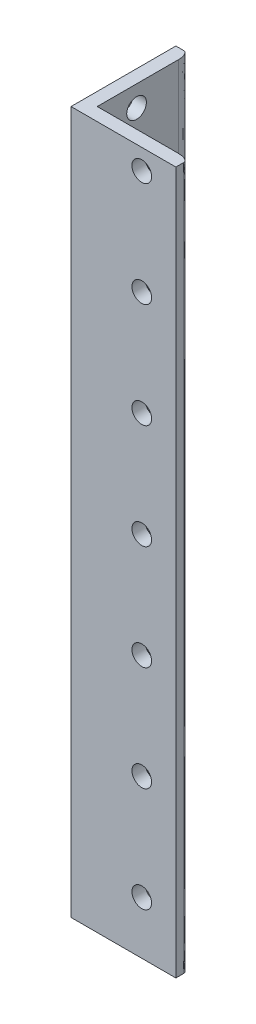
ISO-10303-21;
HEADER;
FILE_DESCRIPTION(('STEP AP214'),'2;1');
FILE_NAME('part.step','',(''),(''),'','','');
FILE_SCHEMA(('AUTOMOTIVE_DESIGN { 1 0 10303 214 1 1 1 1 }'));
ENDSEC;
DATA;
#1=APPLICATION_CONTEXT('core data for automotive mechanical design processes');
#2=APPLICATION_PROTOCOL_DEFINITION('international standard','automotive_design',2000,#1);
#3=PRODUCT_CONTEXT('',#1,'mechanical');
#4=PRODUCT('Part','Part','',(#3));
#5=PRODUCT_RELATED_PRODUCT_CATEGORY('part','',(#4));
#6=PRODUCT_DEFINITION_FORMATION('','',#4);
#7=PRODUCT_DEFINITION_CONTEXT('part definition',#1,'design');
#8=PRODUCT_DEFINITION('design','',#6,#7);
#9=PRODUCT_DEFINITION_SHAPE('','',#8);
#10=(LENGTH_UNIT() NAMED_UNIT(*) SI_UNIT(.MILLI.,.METRE.));
#11=(NAMED_UNIT(*) PLANE_ANGLE_UNIT() SI_UNIT($,.RADIAN.));
#12=(NAMED_UNIT(*) SI_UNIT($,.STERADIAN.) SOLID_ANGLE_UNIT());
#13=UNCERTAINTY_MEASURE_WITH_UNIT(LENGTH_MEASURE(1.E-05),#10,'distance_accuracy_value','');
#14=(GEOMETRIC_REPRESENTATION_CONTEXT(3) GLOBAL_UNCERTAINTY_ASSIGNED_CONTEXT((#13)) GLOBAL_UNIT_ASSIGNED_CONTEXT((#10,
#11,#12)) REPRESENTATION_CONTEXT('',''));
#15=CARTESIAN_POINT('',(0.,0.,0.));
#16=DIRECTION('',(0.,0.,1.));
#17=DIRECTION('',(1.,0.,0.));
#18=AXIS2_PLACEMENT_3D('',#15,#16,#17);
#19=CARTESIAN_POINT('',(0.,170.18,0.));
#20=DIRECTION('',(0.,0.,1.));
#21=DIRECTION('',(1.,0.,0.));
#22=AXIS2_PLACEMENT_3D('',#19,#20,#21);
#23=PLANE('',#22);
#24=DIRECTION('',(-1.,0.,0.));
#25=VECTOR('',#24,1.);
#26=CARTESIAN_POINT('',(0.,170.18,0.));
#27=LINE('',#26,#25);
#28=CARTESIAN_POINT('',(1.905,170.18,0.));
#29=VERTEX_POINT('',#28);
#30=CARTESIAN_POINT('',(0.,170.18,0.));
#31=VERTEX_POINT('',#30);
#32=EDGE_CURVE('E115',#29,#31,#27,.T.);
#33=ORIENTED_EDGE('',*,*,#32,.T.);
#34=DIRECTION('',(0.,1.,0.));
#35=VECTOR('',#34,1.);
#36=CARTESIAN_POINT('',(0.,170.18,0.));
#37=LINE('',#36,#35);
#38=CARTESIAN_POINT('',(0.,340.36,0.));
#39=VERTEX_POINT('',#38);
#40=EDGE_CURVE('E123',#31,#39,#37,.T.);
#41=ORIENTED_EDGE('',*,*,#40,.T.);
#42=DIRECTION('',(-1.,0.,0.));
#43=VECTOR('',#42,1.);
#44=CARTESIAN_POINT('',(0.,340.36,0.));
#45=LINE('',#44,#43);
#46=CARTESIAN_POINT('',(1.905,340.36,0.));
#47=VERTEX_POINT('',#46);
#48=EDGE_CURVE('E143',#47,#39,#45,.T.);
#49=ORIENTED_EDGE('',*,*,#48,.F.);
#50=CARTESIAN_POINT('',(1.905,161.671,0.));
#51=CARTESIAN_POINT('',(1.905,224.070333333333,0.));
#52=CARTESIAN_POINT('',(1.905,286.469666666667,0.));
#53=CARTESIAN_POINT('',(1.905,348.869,0.));
#54=(BOUNDED_CURVE() B_SPLINE_CURVE(3,(#50,#51,#52,#53),.UNSPECIFIED.,.F.,
.F.) B_SPLINE_CURVE_WITH_KNOTS((4,4),(-0.008509,0.178689),
.UNSPECIFIED.) CURVE() GEOMETRIC_REPRESENTATION_ITEM() RATIONAL_B_SPLINE_CURVE((1.,1.,1.,1.)) REPRESENTATION_ITEM(''));
#55=EDGE_CURVE('E130',#29,#47,#54,.T.);
#56=ORIENTED_EDGE('',*,*,#55,.F.);
#57=EDGE_LOOP('',(#33,#41,#49,#56));
#58=FACE_BOUND('',#57,.T.);
#59=ADVANCED_FACE('F42',(#58),#23,.F.);
#60=CARTESIAN_POINT('',(0.,170.18,0.));
#61=DIRECTION('',(1.,0.,0.));
#62=DIRECTION('',(0.,0.,-1.));
#63=AXIS2_PLACEMENT_3D('',#60,#61,#62);
#64=PLANE('',#63);
#65=CARTESIAN_POINT('',(0.,335.28,12.7));
#66=DIRECTION('',(-1.,0.,0.));
#67=DIRECTION('',(0.,0.,-1.));
#68=AXIS2_PLACEMENT_3D('',#65,#66,#67);
#69=CIRCLE('',#68,2.38125);
#70=CARTESIAN_POINT('',(0.,335.28,10.31875));
#71=VERTEX_POINT('',#70);
#72=EDGE_CURVE('E431',#71,#71,#69,.T.);
#73=ORIENTED_EDGE('',*,*,#72,.F.);
#74=EDGE_LOOP('',(#73));
#75=FACE_BOUND('',#74,.T.);
#76=CARTESIAN_POINT('',(0.,309.88,12.7));
#77=DIRECTION('',(-1.,0.,0.));
#78=DIRECTION('',(0.,0.,-1.));
#79=AXIS2_PLACEMENT_3D('',#76,#77,#78);
#80=CIRCLE('',#79,2.38125);
#81=CARTESIAN_POINT('',(0.,309.88,10.31875));
#82=VERTEX_POINT('',#81);
#83=EDGE_CURVE('E425',#82,#82,#80,.T.);
#84=ORIENTED_EDGE('',*,*,#83,.F.);
#85=EDGE_LOOP('',(#84));
#86=FACE_BOUND('',#85,.T.);
#87=CARTESIAN_POINT('',(0.,284.48,12.7));
#88=DIRECTION('',(-1.,0.,0.));
#89=DIRECTION('',(0.,0.,-1.));
#90=AXIS2_PLACEMENT_3D('',#87,#88,#89);
#91=CIRCLE('',#90,2.38125);
#92=CARTESIAN_POINT('',(0.,284.48,10.31875));
#93=VERTEX_POINT('',#92);
#94=EDGE_CURVE('E419',#93,#93,#91,.T.);
#95=ORIENTED_EDGE('',*,*,#94,.F.);
#96=EDGE_LOOP('',(#95));
#97=FACE_BOUND('',#96,.T.);
#98=CARTESIAN_POINT('',(0.,259.08,12.7));
#99=DIRECTION('',(-1.,0.,0.));
#100=DIRECTION('',(0.,0.,-1.));
#101=AXIS2_PLACEMENT_3D('',#98,#99,#100);
#102=CIRCLE('',#101,2.38125);
#103=CARTESIAN_POINT('',(0.,259.08,10.31875));
#104=VERTEX_POINT('',#103);
#105=EDGE_CURVE('E413',#104,#104,#102,.T.);
#106=ORIENTED_EDGE('',*,*,#105,.F.);
#107=EDGE_LOOP('',(#106));
#108=FACE_BOUND('',#107,.T.);
#109=CARTESIAN_POINT('',(0.,233.68,12.7));
#110=DIRECTION('',(-1.,0.,0.));
#111=DIRECTION('',(0.,0.,-1.));
#112=AXIS2_PLACEMENT_3D('',#109,#110,#111);
#113=CIRCLE('',#112,2.38125);
#114=CARTESIAN_POINT('',(0.,233.68,10.31875));
#115=VERTEX_POINT('',#114);
#116=EDGE_CURVE('E407',#115,#115,#113,.T.);
#117=ORIENTED_EDGE('',*,*,#116,.F.);
#118=EDGE_LOOP('',(#117));
#119=FACE_BOUND('',#118,.T.);
#120=CARTESIAN_POINT('',(0.,208.28,12.7));
#121=DIRECTION('',(-1.,0.,0.));
#122=DIRECTION('',(0.,0.,-1.));
#123=AXIS2_PLACEMENT_3D('',#120,#121,#122);
#124=CIRCLE('',#123,2.38125);
#125=CARTESIAN_POINT('',(0.,208.28,10.31875));
#126=VERTEX_POINT('',#125);
#127=EDGE_CURVE('E401',#126,#126,#124,.T.);
#128=ORIENTED_EDGE('',*,*,#127,.F.);
#129=EDGE_LOOP('',(#128));
#130=FACE_BOUND('',#129,.T.);
#131=CARTESIAN_POINT('',(0.,182.88,12.7));
#132=DIRECTION('',(-1.,0.,0.));
#133=DIRECTION('',(0.,0.,-1.));
#134=AXIS2_PLACEMENT_3D('',#131,#132,#133);
#135=CIRCLE('',#134,2.38125);
#136=CARTESIAN_POINT('',(0.,182.88,10.31875));
#137=VERTEX_POINT('',#136);
#138=EDGE_CURVE('E395',#137,#137,#135,.T.);
#139=ORIENTED_EDGE('',*,*,#138,.F.);
#140=EDGE_LOOP('',(#139));
#141=FACE_BOUND('',#140,.T.);
#142=DIRECTION('',(0.,0.,1.));
#143=VECTOR('',#142,1.);
#144=CARTESIAN_POINT('',(0.,340.36,0.));
#145=LINE('',#144,#143);
#146=CARTESIAN_POINT('',(0.,340.36,25.4));
#147=VERTEX_POINT('',#146);
#148=EDGE_CURVE('E126',#39,#147,#145,.T.);
#149=ORIENTED_EDGE('',*,*,#148,.F.);
#150=ORIENTED_EDGE('',*,*,#40,.F.);
#151=DIRECTION('',(0.,0.,1.));
#152=VECTOR('',#151,1.);
#153=CARTESIAN_POINT('',(0.,170.18,0.));
#154=LINE('',#153,#152);
#155=CARTESIAN_POINT('',(0.,170.18,25.4));
#156=VERTEX_POINT('',#155);
#157=EDGE_CURVE('E111',#31,#156,#154,.T.);
#158=ORIENTED_EDGE('',*,*,#157,.T.);
#159=DIRECTION('',(0.,1.,0.));
#160=VECTOR('',#159,1.);
#161=CARTESIAN_POINT('',(0.,170.18,25.4));
#162=LINE('',#161,#160);
#163=EDGE_CURVE('E131',#156,#147,#162,.T.);
#164=ORIENTED_EDGE('',*,*,#163,.T.);
#165=EDGE_LOOP('',(#149,#150,#158,#164));
#166=FACE_BOUND('',#165,.T.);
#167=ADVANCED_FACE('F124',(#75,#86,#97,#108,#119,#130,#141,#166),#64,.F.);
#168=CARTESIAN_POINT('',(0.,170.18,25.4));
#169=DIRECTION('',(0.,0.,-1.));
#170=DIRECTION('',(-1.,0.,0.));
#171=AXIS2_PLACEMENT_3D('',#168,#169,#170);
#172=PLANE('',#171);
#173=CARTESIAN_POINT('',(17.13738,335.38922,25.4));
#174=DIRECTION('',(0.,0.,1.));
#175=DIRECTION('',(-1.,0.,0.));
#176=AXIS2_PLACEMENT_3D('',#173,#174,#175);
#177=CIRCLE('',#176,2.38125);
#178=CARTESIAN_POINT('',(14.75613,335.38922,25.4));
#179=VERTEX_POINT('',#178);
#180=EDGE_CURVE('E389',#179,#179,#177,.T.);
#181=ORIENTED_EDGE('',*,*,#180,.F.);
#182=EDGE_LOOP('',(#181));
#183=FACE_BOUND('',#182,.T.);
#184=CARTESIAN_POINT('',(17.13738,309.98922,25.4));
#185=DIRECTION('',(0.,0.,1.));
#186=DIRECTION('',(-1.,0.,0.));
#187=AXIS2_PLACEMENT_3D('',#184,#185,#186);
#188=CIRCLE('',#187,2.38125);
#189=CARTESIAN_POINT('',(14.75613,309.98922,25.4));
#190=VERTEX_POINT('',#189);
#191=EDGE_CURVE('E383',#190,#190,#188,.T.);
#192=ORIENTED_EDGE('',*,*,#191,.F.);
#193=EDGE_LOOP('',(#192));
#194=FACE_BOUND('',#193,.T.);
#195=CARTESIAN_POINT('',(17.13738,284.58922,25.4));
#196=DIRECTION('',(0.,0.,1.));
#197=DIRECTION('',(-1.,0.,0.));
#198=AXIS2_PLACEMENT_3D('',#195,#196,#197);
#199=CIRCLE('',#198,2.38125);
#200=CARTESIAN_POINT('',(14.75613,284.58922,25.4));
#201=VERTEX_POINT('',#200);
#202=EDGE_CURVE('E377',#201,#201,#199,.T.);
#203=ORIENTED_EDGE('',*,*,#202,.F.);
#204=EDGE_LOOP('',(#203));
#205=FACE_BOUND('',#204,.T.);
#206=CARTESIAN_POINT('',(17.13738,259.18922,25.4));
#207=DIRECTION('',(0.,0.,1.));
#208=DIRECTION('',(-1.,0.,0.));
#209=AXIS2_PLACEMENT_3D('',#206,#207,#208);
#210=CIRCLE('',#209,2.38125);
#211=CARTESIAN_POINT('',(14.75613,259.18922,25.4));
#212=VERTEX_POINT('',#211);
#213=EDGE_CURVE('E371',#212,#212,#210,.T.);
#214=ORIENTED_EDGE('',*,*,#213,.F.);
#215=EDGE_LOOP('',(#214));
#216=FACE_BOUND('',#215,.T.);
#217=CARTESIAN_POINT('',(17.13738,233.78922,25.4));
#218=DIRECTION('',(0.,0.,1.));
#219=DIRECTION('',(-1.,0.,0.));
#220=AXIS2_PLACEMENT_3D('',#217,#218,#219);
#221=CIRCLE('',#220,2.38125);
#222=CARTESIAN_POINT('',(14.75613,233.78922,25.4));
#223=VERTEX_POINT('',#222);
#224=EDGE_CURVE('E365',#223,#223,#221,.T.);
#225=ORIENTED_EDGE('',*,*,#224,.F.);
#226=EDGE_LOOP('',(#225));
#227=FACE_BOUND('',#226,.T.);
#228=CARTESIAN_POINT('',(17.13738,208.38922,25.4));
#229=DIRECTION('',(0.,0.,1.));
#230=DIRECTION('',(-1.,0.,0.));
#231=AXIS2_PLACEMENT_3D('',#228,#229,#230);
#232=CIRCLE('',#231,2.38125);
#233=CARTESIAN_POINT('',(14.75613,208.38922,25.4));
#234=VERTEX_POINT('',#233);
#235=EDGE_CURVE('E359',#234,#234,#232,.T.);
#236=ORIENTED_EDGE('',*,*,#235,.F.);
#237=EDGE_LOOP('',(#236));
#238=FACE_BOUND('',#237,.T.);
#239=CARTESIAN_POINT('',(17.13738,182.98922,25.4));
#240=DIRECTION('',(0.,0.,1.));
#241=DIRECTION('',(-1.,0.,0.));
#242=AXIS2_PLACEMENT_3D('',#239,#240,#241);
#243=CIRCLE('',#242,2.38125);
#244=CARTESIAN_POINT('',(14.75613,182.98922,25.4));
#245=VERTEX_POINT('',#244);
#246=EDGE_CURVE('E230',#245,#245,#243,.T.);
#247=ORIENTED_EDGE('',*,*,#246,.F.);
#248=EDGE_LOOP('',(#247));
#249=FACE_BOUND('',#248,.T.);
#250=DIRECTION('',(1.,0.,0.));
#251=VECTOR('',#250,1.);
#252=CARTESIAN_POINT('',(0.,340.36,25.4));
#253=LINE('',#252,#251);
#254=CARTESIAN_POINT('',(25.4,340.36,25.4));
#255=VERTEX_POINT('',#254);
#256=EDGE_CURVE('E226',#147,#255,#253,.T.);
#257=ORIENTED_EDGE('',*,*,#256,.F.);
#258=ORIENTED_EDGE('',*,*,#163,.F.);
#259=DIRECTION('',(1.,0.,0.));
#260=VECTOR('',#259,1.);
#261=CARTESIAN_POINT('',(0.,170.18,25.4));
#262=LINE('',#261,#260);
#263=CARTESIAN_POINT('',(25.4,170.18,25.4));
#264=VERTEX_POINT('',#263);
#265=EDGE_CURVE('E117',#156,#264,#262,.T.);
#266=ORIENTED_EDGE('',*,*,#265,.T.);
#267=DIRECTION('',(0.,1.,0.));
#268=VECTOR('',#267,1.);
#269=CARTESIAN_POINT('',(25.4,170.18,25.4));
#270=LINE('',#269,#268);
#271=EDGE_CURVE('E217',#264,#255,#270,.T.);
#272=ORIENTED_EDGE('',*,*,#271,.T.);
#273=EDGE_LOOP('',(#257,#258,#266,#272));
#274=FACE_BOUND('',#273,.T.);
#275=ADVANCED_FACE('F184',(#183,#194,#205,#216,#227,#238,#249,#274),#172,.F.);
#276=CARTESIAN_POINT('',(25.4,170.18,22.225));
#277=DIRECTION('',(-1.,0.,0.));
#278=DIRECTION('',(0.,0.,1.));
#279=AXIS2_PLACEMENT_3D('',#276,#277,#278);
#280=PLANE('',#279);
#281=DIRECTION('',(0.,0.,-1.));
#282=VECTOR('',#281,1.);
#283=CARTESIAN_POINT('',(25.4,340.36,22.225));
#284=LINE('',#283,#282);
#285=CARTESIAN_POINT('',(25.4,340.36,23.495));
#286=VERTEX_POINT('',#285);
#287=EDGE_CURVE('E228',#255,#286,#284,.T.);
#288=ORIENTED_EDGE('',*,*,#287,.F.);
#289=ORIENTED_EDGE('',*,*,#271,.F.);
#290=DIRECTION('',(0.,0.,-1.));
#291=VECTOR('',#290,1.);
#292=CARTESIAN_POINT('',(25.4,170.18,22.225));
#293=LINE('',#292,#291);
#294=CARTESIAN_POINT('',(25.4,170.18,23.495));
#295=VERTEX_POINT('',#294);
#296=EDGE_CURVE('E152',#264,#295,#293,.T.);
#297=ORIENTED_EDGE('',*,*,#296,.T.);
#298=CARTESIAN_POINT('',(25.4,348.869,23.495));
#299=CARTESIAN_POINT('',(25.4,286.469666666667,23.495));
#300=CARTESIAN_POINT('',(25.4,224.070333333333,23.495));
#301=CARTESIAN_POINT('',(25.4,161.671,23.495));
#302=(BOUNDED_CURVE() B_SPLINE_CURVE(3,(#298,#299,#300,#301),.UNSPECIFIED.,.F.,
.F.) B_SPLINE_CURVE_WITH_KNOTS((4,4),(-0.00850899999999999,0.178689),
.UNSPECIFIED.) CURVE() GEOMETRIC_REPRESENTATION_ITEM() RATIONAL_B_SPLINE_CURVE((1.,1.,1.,1.)) REPRESENTATION_ITEM(''));
#303=EDGE_CURVE('E55',#286,#295,#302,.T.);
#304=ORIENTED_EDGE('',*,*,#303,.F.);
#305=EDGE_LOOP('',(#288,#289,#297,#304));
#306=FACE_BOUND('',#305,.T.);
#307=ADVANCED_FACE('F173',(#306),#280,.F.);
#308=CARTESIAN_POINT('',(3.175,170.18,22.225));
#309=DIRECTION('',(0.,0.,1.));
#310=DIRECTION('',(1.,0.,0.));
#311=AXIS2_PLACEMENT_3D('',#308,#309,#310);
#312=PLANE('',#311);
#313=CARTESIAN_POINT('',(17.13738,335.38922,22.225));
#314=DIRECTION('',(0.,0.,1.));
#315=DIRECTION('',(-1.,0.,0.));
#316=AXIS2_PLACEMENT_3D('',#313,#314,#315);
#317=CIRCLE('',#316,2.38125);
#318=CARTESIAN_POINT('',(14.75613,335.38922,22.225));
#319=VERTEX_POINT('',#318);
#320=EDGE_CURVE('E392',#319,#319,#317,.T.);
#321=ORIENTED_EDGE('',*,*,#320,.T.);
#322=EDGE_LOOP('',(#321));
#323=FACE_BOUND('',#322,.T.);
#324=CARTESIAN_POINT('',(17.13738,309.98922,22.225));
#325=DIRECTION('',(0.,0.,1.));
#326=DIRECTION('',(-1.,0.,0.));
#327=AXIS2_PLACEMENT_3D('',#324,#325,#326);
#328=CIRCLE('',#327,2.38125);
#329=CARTESIAN_POINT('',(14.75613,309.98922,22.225));
#330=VERTEX_POINT('',#329);
#331=EDGE_CURVE('E386',#330,#330,#328,.T.);
#332=ORIENTED_EDGE('',*,*,#331,.T.);
#333=EDGE_LOOP('',(#332));
#334=FACE_BOUND('',#333,.T.);
#335=CARTESIAN_POINT('',(17.13738,284.58922,22.225));
#336=DIRECTION('',(0.,0.,1.));
#337=DIRECTION('',(-1.,0.,0.));
#338=AXIS2_PLACEMENT_3D('',#335,#336,#337);
#339=CIRCLE('',#338,2.38125);
#340=CARTESIAN_POINT('',(14.75613,284.58922,22.225));
#341=VERTEX_POINT('',#340);
#342=EDGE_CURVE('E380',#341,#341,#339,.T.);
#343=ORIENTED_EDGE('',*,*,#342,.T.);
#344=EDGE_LOOP('',(#343));
#345=FACE_BOUND('',#344,.T.);
#346=CARTESIAN_POINT('',(17.13738,259.18922,22.225));
#347=DIRECTION('',(0.,0.,1.));
#348=DIRECTION('',(-1.,0.,0.));
#349=AXIS2_PLACEMENT_3D('',#346,#347,#348);
#350=CIRCLE('',#349,2.38125);
#351=CARTESIAN_POINT('',(14.75613,259.18922,22.225));
#352=VERTEX_POINT('',#351);
#353=EDGE_CURVE('E374',#352,#352,#350,.T.);
#354=ORIENTED_EDGE('',*,*,#353,.T.);
#355=EDGE_LOOP('',(#354));
#356=FACE_BOUND('',#355,.T.);
#357=CARTESIAN_POINT('',(17.13738,233.78922,22.225));
#358=DIRECTION('',(0.,0.,1.));
#359=DIRECTION('',(-1.,0.,0.));
#360=AXIS2_PLACEMENT_3D('',#357,#358,#359);
#361=CIRCLE('',#360,2.38125);
#362=CARTESIAN_POINT('',(14.75613,233.78922,22.225));
#363=VERTEX_POINT('',#362);
#364=EDGE_CURVE('E368',#363,#363,#361,.T.);
#365=ORIENTED_EDGE('',*,*,#364,.T.);
#366=EDGE_LOOP('',(#365));
#367=FACE_BOUND('',#366,.T.);
#368=CARTESIAN_POINT('',(17.13738,208.38922,22.225));
#369=DIRECTION('',(0.,0.,1.));
#370=DIRECTION('',(-1.,0.,0.));
#371=AXIS2_PLACEMENT_3D('',#368,#369,#370);
#372=CIRCLE('',#371,2.38125);
#373=CARTESIAN_POINT('',(14.75613,208.38922,22.225));
#374=VERTEX_POINT('',#373);
#375=EDGE_CURVE('E361',#374,#374,#372,.T.);
#376=ORIENTED_EDGE('',*,*,#375,.T.);
#377=EDGE_LOOP('',(#376));
#378=FACE_BOUND('',#377,.T.);
#379=CARTESIAN_POINT('',(17.13738,182.98922,22.225));
#380=DIRECTION('',(0.,0.,1.));
#381=DIRECTION('',(-1.,0.,0.));
#382=AXIS2_PLACEMENT_3D('',#379,#380,#381);
#383=CIRCLE('',#382,2.38125);
#384=CARTESIAN_POINT('',(14.75613,182.98922,22.225));
#385=VERTEX_POINT('',#384);
#386=EDGE_CURVE('E148',#385,#385,#383,.T.);
#387=ORIENTED_EDGE('',*,*,#386,.T.);
#388=EDGE_LOOP('',(#387));
#389=FACE_BOUND('',#388,.T.);
#390=DIRECTION('',(-1.,0.,0.));
#391=VECTOR('',#390,1.);
#392=CARTESIAN_POINT('',(3.175,170.18,22.225));
#393=LINE('',#392,#391);
#394=CARTESIAN_POINT('',(22.86,170.18,22.225));
#395=VERTEX_POINT('',#394);
#396=CARTESIAN_POINT('',(3.175,170.18,22.225));
#397=VERTEX_POINT('',#396);
#398=EDGE_CURVE('E161',#395,#397,#393,.T.);
#399=ORIENTED_EDGE('',*,*,#398,.T.);
#400=DIRECTION('',(0.,1.,0.));
#401=VECTOR('',#400,1.);
#402=CARTESIAN_POINT('',(3.175,170.18,22.225));
#403=LINE('',#402,#401);
#404=CARTESIAN_POINT('',(3.175,340.36,22.225));
#405=VERTEX_POINT('',#404);
#406=EDGE_CURVE('E214',#397,#405,#403,.T.);
#407=ORIENTED_EDGE('',*,*,#406,.T.);
#408=DIRECTION('',(-1.,0.,0.));
#409=VECTOR('',#408,1.);
#410=CARTESIAN_POINT('',(3.175,340.36,22.225));
#411=LINE('',#410,#409);
#412=CARTESIAN_POINT('',(22.86,340.36,22.225));
#413=VERTEX_POINT('',#412);
#414=EDGE_CURVE('E139',#413,#405,#411,.T.);
#415=ORIENTED_EDGE('',*,*,#414,.F.);
#416=CARTESIAN_POINT('',(22.86,161.671,22.225));
#417=CARTESIAN_POINT('',(22.86,224.070333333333,22.225));
#418=CARTESIAN_POINT('',(22.86,286.469666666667,22.225));
#419=CARTESIAN_POINT('',(22.86,348.869,22.225));
#420=(BOUNDED_CURVE() B_SPLINE_CURVE(3,(#416,#417,#418,#419),.UNSPECIFIED.,.F.,
.F.) B_SPLINE_CURVE_WITH_KNOTS((4,4),(-0.008509,0.178689),
.UNSPECIFIED.) CURVE() GEOMETRIC_REPRESENTATION_ITEM() RATIONAL_B_SPLINE_CURVE((1.,1.,1.,1.)) REPRESENTATION_ITEM(''));
#421=EDGE_CURVE('E239',#395,#413,#420,.T.);
#422=ORIENTED_EDGE('',*,*,#421,.F.);
#423=EDGE_LOOP('',(#399,#407,#415,#422));
#424=FACE_BOUND('',#423,.T.);
#425=ADVANCED_FACE('F183',(#323,#334,#345,#356,#367,#378,#389,#424),#312,.F.);
#426=CARTESIAN_POINT('',(3.175,170.18,0.));
#427=DIRECTION('',(-1.,0.,0.));
#428=DIRECTION('',(0.,0.,1.));
#429=AXIS2_PLACEMENT_3D('',#426,#427,#428);
#430=PLANE('',#429);
#431=CARTESIAN_POINT('',(3.175,335.28,12.7));
#432=DIRECTION('',(-1.,0.,0.));
#433=DIRECTION('',(0.,0.,-1.));
#434=AXIS2_PLACEMENT_3D('',#431,#432,#433);
#435=CIRCLE('',#434,2.38125);
#436=CARTESIAN_POINT('',(3.175,335.28,10.31875));
#437=VERTEX_POINT('',#436);
#438=EDGE_CURVE('E434',#437,#437,#435,.T.);
#439=ORIENTED_EDGE('',*,*,#438,.T.);
#440=EDGE_LOOP('',(#439));
#441=FACE_BOUND('',#440,.T.);
#442=CARTESIAN_POINT('',(3.175,309.88,12.7));
#443=DIRECTION('',(-1.,0.,0.));
#444=DIRECTION('',(0.,0.,-1.));
#445=AXIS2_PLACEMENT_3D('',#442,#443,#444);
#446=CIRCLE('',#445,2.38125);
#447=CARTESIAN_POINT('',(3.175,309.88,10.31875));
#448=VERTEX_POINT('',#447);
#449=EDGE_CURVE('E428',#448,#448,#446,.T.);
#450=ORIENTED_EDGE('',*,*,#449,.T.);
#451=EDGE_LOOP('',(#450));
#452=FACE_BOUND('',#451,.T.);
#453=CARTESIAN_POINT('',(3.175,284.48,12.7));
#454=DIRECTION('',(-1.,0.,0.));
#455=DIRECTION('',(0.,0.,-1.));
#456=AXIS2_PLACEMENT_3D('',#453,#454,#455);
#457=CIRCLE('',#456,2.38125);
#458=CARTESIAN_POINT('',(3.175,284.48,10.31875));
#459=VERTEX_POINT('',#458);
#460=EDGE_CURVE('E422',#459,#459,#457,.T.);
#461=ORIENTED_EDGE('',*,*,#460,.T.);
#462=EDGE_LOOP('',(#461));
#463=FACE_BOUND('',#462,.T.);
#464=CARTESIAN_POINT('',(3.175,259.08,12.7));
#465=DIRECTION('',(-1.,0.,0.));
#466=DIRECTION('',(0.,0.,-1.));
#467=AXIS2_PLACEMENT_3D('',#464,#465,#466);
#468=CIRCLE('',#467,2.38125);
#469=CARTESIAN_POINT('',(3.175,259.08,10.31875));
#470=VERTEX_POINT('',#469);
#471=EDGE_CURVE('E416',#470,#470,#468,.T.);
#472=ORIENTED_EDGE('',*,*,#471,.T.);
#473=EDGE_LOOP('',(#472));
#474=FACE_BOUND('',#473,.T.);
#475=CARTESIAN_POINT('',(3.175,233.68,12.7));
#476=DIRECTION('',(-1.,0.,0.));
#477=DIRECTION('',(0.,0.,-1.));
#478=AXIS2_PLACEMENT_3D('',#475,#476,#477);
#479=CIRCLE('',#478,2.38125);
#480=CARTESIAN_POINT('',(3.175,233.68,10.31875));
#481=VERTEX_POINT('',#480);
#482=EDGE_CURVE('E410',#481,#481,#479,.T.);
#483=ORIENTED_EDGE('',*,*,#482,.T.);
#484=EDGE_LOOP('',(#483));
#485=FACE_BOUND('',#484,.T.);
#486=CARTESIAN_POINT('',(3.175,208.28,12.7));
#487=DIRECTION('',(-1.,0.,0.));
#488=DIRECTION('',(0.,0.,-1.));
#489=AXIS2_PLACEMENT_3D('',#486,#487,#488);
#490=CIRCLE('',#489,2.38125);
#491=CARTESIAN_POINT('',(3.175,208.28,10.31875));
#492=VERTEX_POINT('',#491);
#493=EDGE_CURVE('E404',#492,#492,#490,.T.);
#494=ORIENTED_EDGE('',*,*,#493,.T.);
#495=EDGE_LOOP('',(#494));
#496=FACE_BOUND('',#495,.T.);
#497=CARTESIAN_POINT('',(3.175,182.88,12.7));
#498=DIRECTION('',(-1.,0.,0.));
#499=DIRECTION('',(0.,0.,-1.));
#500=AXIS2_PLACEMENT_3D('',#497,#498,#499);
#501=CIRCLE('',#500,2.38125);
#502=CARTESIAN_POINT('',(3.175,182.88,10.31875));
#503=VERTEX_POINT('',#502);
#504=EDGE_CURVE('E398',#503,#503,#501,.T.);
#505=ORIENTED_EDGE('',*,*,#504,.T.);
#506=EDGE_LOOP('',(#505));
#507=FACE_BOUND('',#506,.T.);
#508=DIRECTION('',(0.,0.,-1.));
#509=VECTOR('',#508,1.);
#510=CARTESIAN_POINT('',(3.175,340.36,0.));
#511=LINE('',#510,#509);
#512=CARTESIAN_POINT('',(3.175,340.36,2.54));
#513=VERTEX_POINT('',#512);
#514=EDGE_CURVE('E136',#405,#513,#511,.T.);
#515=ORIENTED_EDGE('',*,*,#514,.F.);
#516=ORIENTED_EDGE('',*,*,#406,.F.);
#517=DIRECTION('',(0.,0.,-1.));
#518=VECTOR('',#517,1.);
#519=CARTESIAN_POINT('',(3.175,170.18,0.));
#520=LINE('',#519,#518);
#521=CARTESIAN_POINT('',(3.175,170.18,2.54));
#522=VERTEX_POINT('',#521);
#523=EDGE_CURVE('E218',#397,#522,#520,.T.);
#524=ORIENTED_EDGE('',*,*,#523,.T.);
#525=CARTESIAN_POINT('',(3.175,348.869,2.54));
#526=CARTESIAN_POINT('',(3.175,286.469666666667,2.54));
#527=CARTESIAN_POINT('',(3.175,224.070333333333,2.54));
#528=CARTESIAN_POINT('',(3.175,161.671,2.54));
#529=(BOUNDED_CURVE() B_SPLINE_CURVE(3,(#525,#526,#527,#528),.UNSPECIFIED.,.F.,
.F.) B_SPLINE_CURVE_WITH_KNOTS((4,4),(-0.00850899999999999,0.178689),
.UNSPECIFIED.) CURVE() GEOMETRIC_REPRESENTATION_ITEM() RATIONAL_B_SPLINE_CURVE((1.,1.,1.,1.)) REPRESENTATION_ITEM(''));
#530=EDGE_CURVE('E265',#513,#522,#529,.T.);
#531=ORIENTED_EDGE('',*,*,#530,.F.);
#532=EDGE_LOOP('',(#515,#516,#524,#531));
#533=FACE_BOUND('',#532,.T.);
#534=ADVANCED_FACE('F270',(#441,#452,#463,#474,#485,#496,#507,#533),#430,.F.);
#535=CARTESIAN_POINT('',(0.,170.18,0.));
#536=DIRECTION('',(0.,1.,0.));
#537=DIRECTION('',(0.,0.,-1.));
#538=AXIS2_PLACEMENT_3D('',#535,#536,#537);
#539=PLANE('',#538);
#540=ORIENTED_EDGE('',*,*,#296,.F.);
#541=ORIENTED_EDGE('',*,*,#265,.F.);
#542=ORIENTED_EDGE('',*,*,#157,.F.);
#543=ORIENTED_EDGE('',*,*,#32,.F.);
#544=CARTESIAN_POINT('',(3.175,170.18,2.54));
#545=CARTESIAN_POINT('',(3.175,170.18,0.));
#546=CARTESIAN_POINT('',(1.905,170.18,0.));
#547=(BOUNDED_CURVE() B_SPLINE_CURVE(2,(#544,#545,#546),.UNSPECIFIED.,.F.,
.F.) B_SPLINE_CURVE_WITH_KNOTS((3,3),(0.,1.),
.UNSPECIFIED.) CURVE() GEOMETRIC_REPRESENTATION_ITEM() RATIONAL_B_SPLINE_CURVE((1.,
0.707106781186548,1.)) REPRESENTATION_ITEM(''));
#548=EDGE_CURVE('E245',#522,#29,#547,.T.);
#549=ORIENTED_EDGE('',*,*,#548,.F.);
#550=ORIENTED_EDGE('',*,*,#523,.F.);
#551=ORIENTED_EDGE('',*,*,#398,.F.);
#552=CARTESIAN_POINT('',(25.4,170.18,23.495));
#553=CARTESIAN_POINT('',(25.4,170.18,22.225));
#554=CARTESIAN_POINT('',(22.86,170.18,22.225));
#555=(BOUNDED_CURVE() B_SPLINE_CURVE(2,(#552,#553,#554),.UNSPECIFIED.,.F.,
.F.) B_SPLINE_CURVE_WITH_KNOTS((3,3),(0.,1.),
.UNSPECIFIED.) CURVE() GEOMETRIC_REPRESENTATION_ITEM() RATIONAL_B_SPLINE_CURVE((1.,
0.707106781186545,1.)) REPRESENTATION_ITEM(''));
#556=EDGE_CURVE('E12',#295,#395,#555,.T.);
#557=ORIENTED_EDGE('',*,*,#556,.F.);
#558=EDGE_LOOP('',(#540,#541,#542,#543,#549,#550,#551,#557));
#559=FACE_BOUND('',#558,.T.);
#560=ADVANCED_FACE('F113',(#559),#539,.F.);
#561=CARTESIAN_POINT('',(0.,340.36,0.));
#562=DIRECTION('',(0.,1.,0.));
#563=DIRECTION('',(0.,0.,-1.));
#564=AXIS2_PLACEMENT_3D('',#561,#562,#563);
#565=PLANE('',#564);
#566=ORIENTED_EDGE('',*,*,#414,.T.);
#567=ORIENTED_EDGE('',*,*,#514,.T.);
#568=CARTESIAN_POINT('',(1.905,340.36,0.));
#569=CARTESIAN_POINT('',(3.175,340.36,0.));
#570=CARTESIAN_POINT('',(3.175,340.36,2.54));
#571=(BOUNDED_CURVE() B_SPLINE_CURVE(2,(#568,#569,#570),.UNSPECIFIED.,.F.,
.F.) B_SPLINE_CURVE_WITH_KNOTS((3,3),(0.,1.),
.UNSPECIFIED.) CURVE() GEOMETRIC_REPRESENTATION_ITEM() RATIONAL_B_SPLINE_CURVE((1.,
0.707106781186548,1.)) REPRESENTATION_ITEM(''));
#572=EDGE_CURVE('E313',#47,#513,#571,.T.);
#573=ORIENTED_EDGE('',*,*,#572,.F.);
#574=ORIENTED_EDGE('',*,*,#48,.T.);
#575=ORIENTED_EDGE('',*,*,#148,.T.);
#576=ORIENTED_EDGE('',*,*,#256,.T.);
#577=ORIENTED_EDGE('',*,*,#287,.T.);
#578=CARTESIAN_POINT('',(22.86,340.36,22.225));
#579=CARTESIAN_POINT('',(25.4,340.36,22.225));
#580=CARTESIAN_POINT('',(25.4,340.36,23.495));
#581=(BOUNDED_CURVE() B_SPLINE_CURVE(2,(#578,#579,#580),.UNSPECIFIED.,.F.,
.F.) B_SPLINE_CURVE_WITH_KNOTS((3,3),(0.,1.),
.UNSPECIFIED.) CURVE() GEOMETRIC_REPRESENTATION_ITEM() RATIONAL_B_SPLINE_CURVE((1.,
0.707106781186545,1.)) REPRESENTATION_ITEM(''));
#582=EDGE_CURVE('E68',#413,#286,#581,.T.);
#583=ORIENTED_EDGE('',*,*,#582,.F.);
#584=EDGE_LOOP('',(#566,#567,#573,#574,#575,#576,#577,#583));
#585=FACE_BOUND('',#584,.T.);
#586=ADVANCED_FACE('F225',(#585),#565,.T.);
#587=CARTESIAN_POINT('',(1.905,161.671,0.));
#588=CARTESIAN_POINT('',(1.905,224.070333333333,0.));
#589=CARTESIAN_POINT('',(1.905,286.469666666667,0.));
#590=CARTESIAN_POINT('',(1.905,348.869,0.));
#591=CARTESIAN_POINT('',(3.175,161.671,0.));
#592=CARTESIAN_POINT('',(3.175,224.070333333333,0.));
#593=CARTESIAN_POINT('',(3.175,286.469666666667,0.));
#594=CARTESIAN_POINT('',(3.175,348.869,0.));
#595=CARTESIAN_POINT('',(3.175,161.671,2.54));
#596=CARTESIAN_POINT('',(3.175,224.070333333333,2.54));
#597=CARTESIAN_POINT('',(3.175,286.469666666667,2.54));
#598=CARTESIAN_POINT('',(3.175,348.869,2.54));
#599=(BOUNDED_SURFACE() B_SPLINE_SURFACE(2,3,((#587,#588,#589,#590),(#591,#592,#593,#594),(#595,
#596,#597,#598)),.UNSPECIFIED.,.F.,.F.,.F.) B_SPLINE_SURFACE_WITH_KNOTS((3,3),(4,4),(0.,1.),
(-0.008509,0.178689),
.UNSPECIFIED.) GEOMETRIC_REPRESENTATION_ITEM() RATIONAL_B_SPLINE_SURFACE(((1.,1.,1.,1.),
(0.707106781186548,0.707106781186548,0.707106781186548,0.707106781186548),(1.,1.,1.,1.))) REPRESENTATION_ITEM('') SURFACE());
#600=ORIENTED_EDGE('',*,*,#548,.T.);
#601=ORIENTED_EDGE('',*,*,#55,.T.);
#602=ORIENTED_EDGE('',*,*,#572,.T.);
#603=ORIENTED_EDGE('',*,*,#530,.T.);
#604=EDGE_LOOP('',(#600,#601,#602,#603));
#605=FACE_BOUND('',#604,.T.);
#606=ADVANCED_FACE('F195',(#605),#599,.F.);
#607=CARTESIAN_POINT('',(22.86,161.671,22.225));
#608=CARTESIAN_POINT('',(22.86,224.070333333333,22.225));
#609=CARTESIAN_POINT('',(22.86,286.469666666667,22.225));
#610=CARTESIAN_POINT('',(22.86,348.869,22.225));
#611=CARTESIAN_POINT('',(25.4,161.671,22.225));
#612=CARTESIAN_POINT('',(25.4,224.070333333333,22.225));
#613=CARTESIAN_POINT('',(25.4,286.469666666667,22.225));
#614=CARTESIAN_POINT('',(25.4,348.869,22.225));
#615=CARTESIAN_POINT('',(25.4,161.671,23.495));
#616=CARTESIAN_POINT('',(25.4,224.070333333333,23.495));
#617=CARTESIAN_POINT('',(25.4,286.469666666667,23.495));
#618=CARTESIAN_POINT('',(25.4,348.869,23.495));
#619=(BOUNDED_SURFACE() B_SPLINE_SURFACE(2,3,((#607,#608,#609,#610),(#611,#612,#613,#614),(#615,
#616,#617,#618)),.UNSPECIFIED.,.F.,.F.,.F.) B_SPLINE_SURFACE_WITH_KNOTS((3,3),(4,4),(0.,1.),
(-0.008509,0.178689),
.UNSPECIFIED.) GEOMETRIC_REPRESENTATION_ITEM() RATIONAL_B_SPLINE_SURFACE(((1.,1.,1.,1.),
(0.707106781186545,0.707106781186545,0.707106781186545,0.707106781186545),(1.,1.,1.,1.))) REPRESENTATION_ITEM('') SURFACE());
#620=ORIENTED_EDGE('',*,*,#556,.T.);
#621=ORIENTED_EDGE('',*,*,#421,.T.);
#622=ORIENTED_EDGE('',*,*,#582,.T.);
#623=ORIENTED_EDGE('',*,*,#303,.T.);
#624=EDGE_LOOP('',(#620,#621,#622,#623));
#625=FACE_BOUND('',#624,.T.);
#626=ADVANCED_FACE('F44',(#625),#619,.F.);
#627=CARTESIAN_POINT('',(17.13738,182.98922,25.4));
#628=DIRECTION('',(0.,0.,-1.));
#629=DIRECTION('',(-1.,0.,0.));
#630=AXIS2_PLACEMENT_3D('',#627,#628,#629);
#631=CYLINDRICAL_SURFACE('',#630,2.38125);
#632=ORIENTED_EDGE('',*,*,#246,.T.);
#633=EDGE_LOOP('',(#632));
#634=FACE_BOUND('',#633,.T.);
#635=ORIENTED_EDGE('',*,*,#386,.F.);
#636=EDGE_LOOP('',(#635));
#637=FACE_BOUND('',#636,.T.);
#638=ADVANCED_FACE('F286',(#634,#637),#631,.F.);
#639=CARTESIAN_POINT('',(17.13738,208.38922,25.4));
#640=DIRECTION('',(0.,0.,-1.));
#641=DIRECTION('',(-1.,0.,0.));
#642=AXIS2_PLACEMENT_3D('',#639,#640,#641);
#643=CYLINDRICAL_SURFACE('',#642,2.38125);
#644=ORIENTED_EDGE('',*,*,#235,.T.);
#645=EDGE_LOOP('',(#644));
#646=FACE_BOUND('',#645,.T.);
#647=ORIENTED_EDGE('',*,*,#375,.F.);
#648=EDGE_LOOP('',(#647));
#649=FACE_BOUND('',#648,.T.);
#650=ADVANCED_FACE('F346',(#646,#649),#643,.F.);
#651=CARTESIAN_POINT('',(17.13738,233.78922,25.4));
#652=DIRECTION('',(0.,0.,-1.));
#653=DIRECTION('',(-1.,0.,0.));
#654=AXIS2_PLACEMENT_3D('',#651,#652,#653);
#655=CYLINDRICAL_SURFACE('',#654,2.38125);
#656=ORIENTED_EDGE('',*,*,#224,.T.);
#657=EDGE_LOOP('',(#656));
#658=FACE_BOUND('',#657,.T.);
#659=ORIENTED_EDGE('',*,*,#364,.F.);
#660=EDGE_LOOP('',(#659));
#661=FACE_BOUND('',#660,.T.);
#662=ADVANCED_FACE('F351',(#658,#661),#655,.F.);
#663=CARTESIAN_POINT('',(17.13738,259.18922,25.4));
#664=DIRECTION('',(0.,0.,-1.));
#665=DIRECTION('',(-1.,0.,0.));
#666=AXIS2_PLACEMENT_3D('',#663,#664,#665);
#667=CYLINDRICAL_SURFACE('',#666,2.38125);
#668=ORIENTED_EDGE('',*,*,#213,.T.);
#669=EDGE_LOOP('',(#668));
#670=FACE_BOUND('',#669,.T.);
#671=ORIENTED_EDGE('',*,*,#353,.F.);
#672=EDGE_LOOP('',(#671));
#673=FACE_BOUND('',#672,.T.);
#674=ADVANCED_FACE('F481',(#670,#673),#667,.F.);
#675=CARTESIAN_POINT('',(17.13738,284.58922,25.4));
#676=DIRECTION('',(0.,0.,-1.));
#677=DIRECTION('',(-1.,0.,0.));
#678=AXIS2_PLACEMENT_3D('',#675,#676,#677);
#679=CYLINDRICAL_SURFACE('',#678,2.38125);
#680=ORIENTED_EDGE('',*,*,#202,.T.);
#681=EDGE_LOOP('',(#680));
#682=FACE_BOUND('',#681,.T.);
#683=ORIENTED_EDGE('',*,*,#342,.F.);
#684=EDGE_LOOP('',(#683));
#685=FACE_BOUND('',#684,.T.);
#686=ADVANCED_FACE('F477',(#682,#685),#679,.F.);
#687=CARTESIAN_POINT('',(17.13738,309.98922,25.4));
#688=DIRECTION('',(0.,0.,-1.));
#689=DIRECTION('',(-1.,0.,0.));
#690=AXIS2_PLACEMENT_3D('',#687,#688,#689);
#691=CYLINDRICAL_SURFACE('',#690,2.38125);
#692=ORIENTED_EDGE('',*,*,#191,.T.);
#693=EDGE_LOOP('',(#692));
#694=FACE_BOUND('',#693,.T.);
#695=ORIENTED_EDGE('',*,*,#331,.F.);
#696=EDGE_LOOP('',(#695));
#697=FACE_BOUND('',#696,.T.);
#698=ADVANCED_FACE('F470',(#694,#697),#691,.F.);
#699=CARTESIAN_POINT('',(17.13738,335.38922,25.4));
#700=DIRECTION('',(0.,0.,-1.));
#701=DIRECTION('',(-1.,0.,0.));
#702=AXIS2_PLACEMENT_3D('',#699,#700,#701);
#703=CYLINDRICAL_SURFACE('',#702,2.38125);
#704=ORIENTED_EDGE('',*,*,#180,.T.);
#705=EDGE_LOOP('',(#704));
#706=FACE_BOUND('',#705,.T.);
#707=ORIENTED_EDGE('',*,*,#320,.F.);
#708=EDGE_LOOP('',(#707));
#709=FACE_BOUND('',#708,.T.);
#710=ADVANCED_FACE('F459',(#706,#709),#703,.F.);
#711=CARTESIAN_POINT('',(0.,182.88,12.7));
#712=DIRECTION('',(1.,0.,0.));
#713=DIRECTION('',(0.,0.,-1.));
#714=AXIS2_PLACEMENT_3D('',#711,#712,#713);
#715=CYLINDRICAL_SURFACE('',#714,2.38125);
#716=ORIENTED_EDGE('',*,*,#138,.T.);
#717=EDGE_LOOP('',(#716));
#718=FACE_BOUND('',#717,.T.);
#719=ORIENTED_EDGE('',*,*,#504,.F.);
#720=EDGE_LOOP('',(#719));
#721=FACE_BOUND('',#720,.T.);
#722=ADVANCED_FACE('F455',(#718,#721),#715,.F.);
#723=CARTESIAN_POINT('',(0.,208.28,12.7));
#724=DIRECTION('',(1.,0.,0.));
#725=DIRECTION('',(0.,0.,-1.));
#726=AXIS2_PLACEMENT_3D('',#723,#724,#725);
#727=CYLINDRICAL_SURFACE('',#726,2.38125);
#728=ORIENTED_EDGE('',*,*,#127,.T.);
#729=EDGE_LOOP('',(#728));
#730=FACE_BOUND('',#729,.T.);
#731=ORIENTED_EDGE('',*,*,#493,.F.);
#732=EDGE_LOOP('',(#731));
#733=FACE_BOUND('',#732,.T.);
#734=ADVANCED_FACE('F458',(#730,#733),#727,.F.);
#735=CARTESIAN_POINT('',(0.,233.68,12.7));
#736=DIRECTION('',(1.,0.,0.));
#737=DIRECTION('',(0.,0.,-1.));
#738=AXIS2_PLACEMENT_3D('',#735,#736,#737);
#739=CYLINDRICAL_SURFACE('',#738,2.38125);
#740=ORIENTED_EDGE('',*,*,#116,.T.);
#741=EDGE_LOOP('',(#740));
#742=FACE_BOUND('',#741,.T.);
#743=ORIENTED_EDGE('',*,*,#482,.F.);
#744=EDGE_LOOP('',(#743));
#745=FACE_BOUND('',#744,.T.);
#746=ADVANCED_FACE('F467',(#742,#745),#739,.F.);
#747=CARTESIAN_POINT('',(0.,259.08,12.7));
#748=DIRECTION('',(1.,0.,0.));
#749=DIRECTION('',(0.,0.,-1.));
#750=AXIS2_PLACEMENT_3D('',#747,#748,#749);
#751=CYLINDRICAL_SURFACE('',#750,2.38125);
#752=ORIENTED_EDGE('',*,*,#105,.T.);
#753=EDGE_LOOP('',(#752));
#754=FACE_BOUND('',#753,.T.);
#755=ORIENTED_EDGE('',*,*,#471,.F.);
#756=EDGE_LOOP('',(#755));
#757=FACE_BOUND('',#756,.T.);
#758=ADVANCED_FACE('F591',(#754,#757),#751,.F.);
#759=CARTESIAN_POINT('',(0.,284.48,12.7));
#760=DIRECTION('',(1.,0.,0.));
#761=DIRECTION('',(0.,0.,-1.));
#762=AXIS2_PLACEMENT_3D('',#759,#760,#761);
#763=CYLINDRICAL_SURFACE('',#762,2.38125);
#764=ORIENTED_EDGE('',*,*,#94,.T.);
#765=EDGE_LOOP('',(#764));
#766=FACE_BOUND('',#765,.T.);
#767=ORIENTED_EDGE('',*,*,#460,.F.);
#768=EDGE_LOOP('',(#767));
#769=FACE_BOUND('',#768,.T.);
#770=ADVANCED_FACE('F600',(#766,#769),#763,.F.);
#771=CARTESIAN_POINT('',(0.,309.88,12.7));
#772=DIRECTION('',(1.,0.,0.));
#773=DIRECTION('',(0.,0.,-1.));
#774=AXIS2_PLACEMENT_3D('',#771,#772,#773);
#775=CYLINDRICAL_SURFACE('',#774,2.38125);
#776=ORIENTED_EDGE('',*,*,#83,.T.);
#777=EDGE_LOOP('',(#776));
#778=FACE_BOUND('',#777,.T.);
#779=ORIENTED_EDGE('',*,*,#449,.F.);
#780=EDGE_LOOP('',(#779));
#781=FACE_BOUND('',#780,.T.);
#782=ADVANCED_FACE('F610',(#778,#781),#775,.F.);
#783=CARTESIAN_POINT('',(0.,335.28,12.7));
#784=DIRECTION('',(1.,0.,0.));
#785=DIRECTION('',(0.,0.,-1.));
#786=AXIS2_PLACEMENT_3D('',#783,#784,#785);
#787=CYLINDRICAL_SURFACE('',#786,2.38125);
#788=ORIENTED_EDGE('',*,*,#72,.T.);
#789=EDGE_LOOP('',(#788));
#790=FACE_BOUND('',#789,.T.);
#791=ORIENTED_EDGE('',*,*,#438,.F.);
#792=EDGE_LOOP('',(#791));
#793=FACE_BOUND('',#792,.T.);
#794=ADVANCED_FACE('F440',(#790,#793),#787,.F.);
#795=CLOSED_SHELL('',(#59,#167,#275,#307,#425,#534,#560,#586,#606,#626,#638,#650,#662,#674,#686,
#698,#710,#722,#734,#746,#758,#770,#782,#794));
#796=MANIFOLD_SOLID_BREP('B2',#795);
#797=ADVANCED_BREP_SHAPE_REPRESENTATION('',(#18,#796),#14);
#798=SHAPE_DEFINITION_REPRESENTATION(#9,#797);
ENDSEC;
END-ISO-10303-21;
